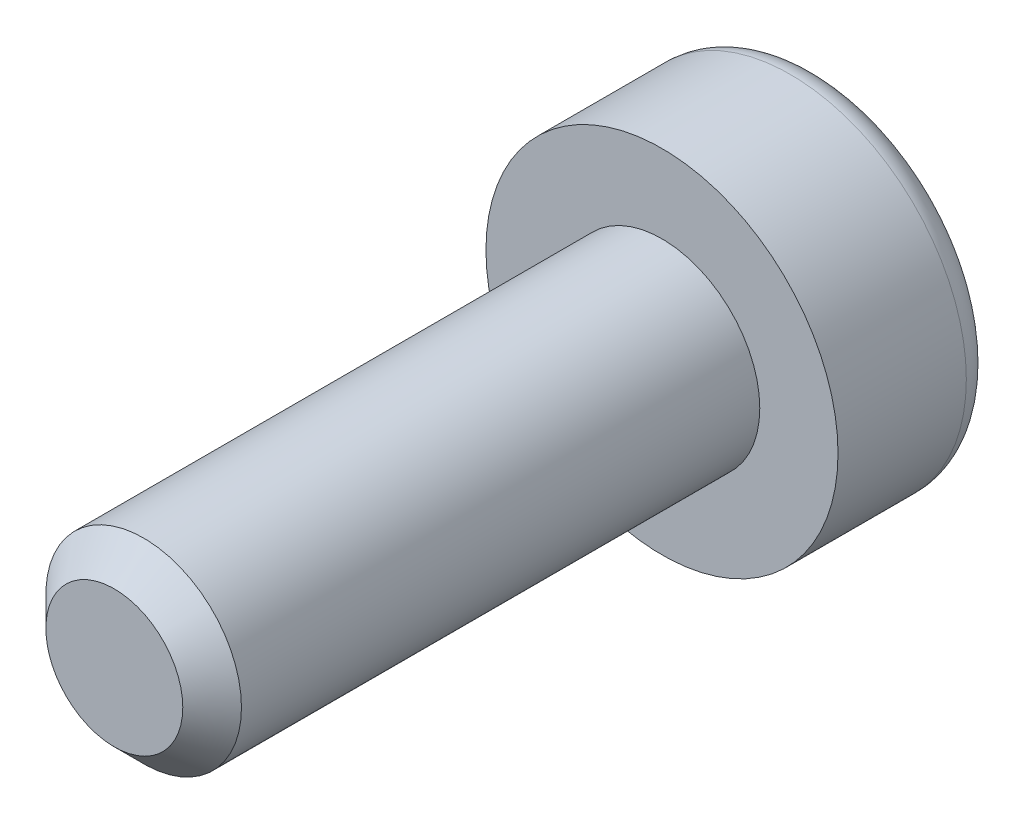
from build123d import *

# Parameters (mm, degrees)
ESQUISSE1_R     = 5
CORPS_DEPTH     = 28
ESQUISSE2_R     = 9
TETE_DEPTH      = 8
F_6PANS_DEPTH   = 5.6
CHANFREIN2_SIZE = 1.5
CONG_1_R        = 1.44


with BuildPart() as part:
    # Esquisse1 → Corps (new body)
    with BuildSketch(Plane.XY):
        Circle(ESQUISSE1_R)
    extrude(amount=CORPS_DEPTH)

    # Esquisse2 → Tete (add)
    with BuildSketch(Plane.XY):
        Circle(ESQUISSE2_R)
    extrude(amount=-TETE_DEPTH)

    # Esquisse3 → 6pans (cut)
    with BuildSketch(Plane.XY.offset(-8)):
        Polygon((0, -3.464101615), (3, -1.732050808), (3, 1.732050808), (0, 3.464101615), (-3, 1.732050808), (-3, -1.732050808), align=None)
    extrude(amount=F_6PANS_DEPTH, mode=Mode.SUBTRACT)

    # Chanfrein2
    chanfrein2_edges = [part.edges().sort_by_distance(p)[0] for p in [
        (-5, 0, 28),
    ]]
    chamfer(chanfrein2_edges, length=CHANFREIN2_SIZE)

    # Cong_1
    cong_1_edges = [part.edges().sort_by_distance(p)[0] for p in [
        (-9, 0, -8),
    ]]
    fillet(cong_1_edges, radius=CONG_1_R)


solid = part.part
